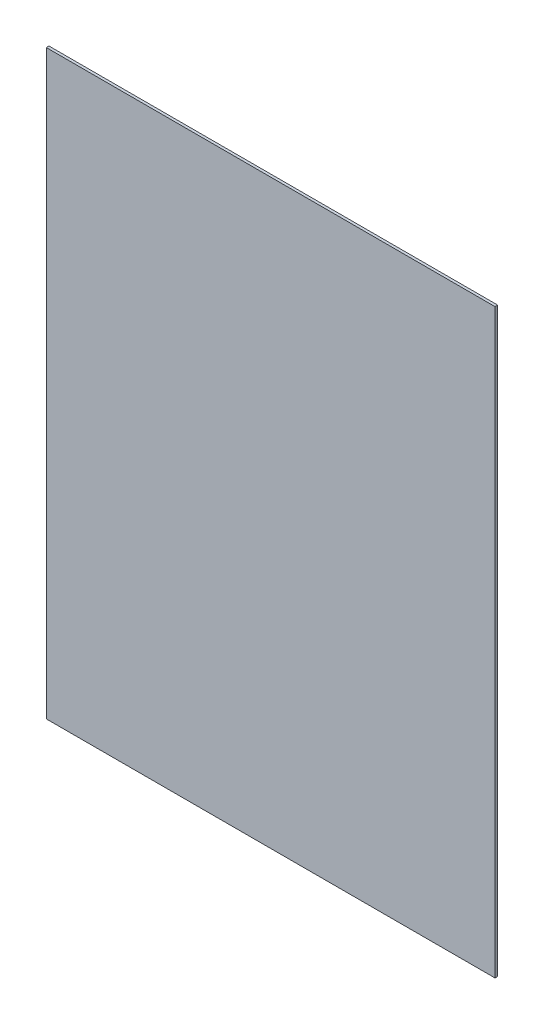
from build123d import *

# Parameters (mm, degrees)
SKETCH1_W           = 505.5
SKETCH1_H           = 655
BOSS_EXTRUDE1_DEPTH = 3


with BuildPart() as part:
    # Sketch1 → Boss-Extrude1 (new body)
    with BuildSketch(Plane.XY):
        with Locations((252.75, 327.5)):
            Rectangle(SKETCH1_W, SKETCH1_H)
    extrude(amount=BOSS_EXTRUDE1_DEPTH)


solid = part.part
